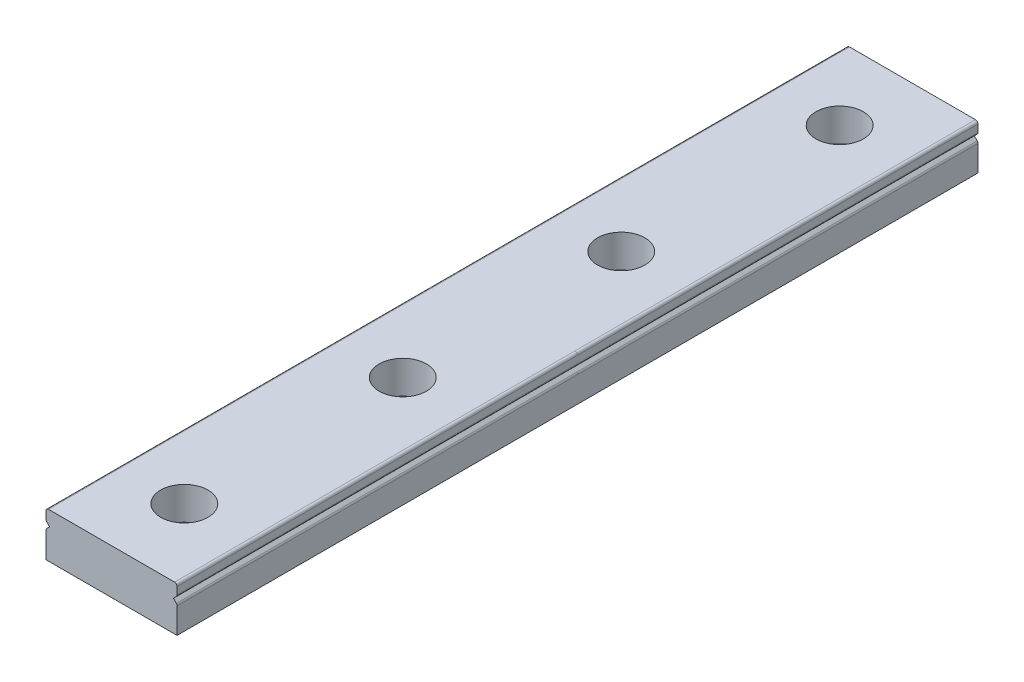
ISO-10303-21;
HEADER;
FILE_DESCRIPTION(('STEP AP214'),'2;1');
FILE_NAME('part.step','',(''),(''),'','','');
FILE_SCHEMA(('AUTOMOTIVE_DESIGN { 1 0 10303 214 1 1 1 1 }'));
ENDSEC;
DATA;
#1=APPLICATION_CONTEXT('core data for automotive mechanical design processes');
#2=APPLICATION_PROTOCOL_DEFINITION('international standard','automotive_design',2000,#1);
#3=PRODUCT_CONTEXT('',#1,'mechanical');
#4=PRODUCT('Part','Part','',(#3));
#5=PRODUCT_RELATED_PRODUCT_CATEGORY('part','',(#4));
#6=PRODUCT_DEFINITION_FORMATION('','',#4);
#7=PRODUCT_DEFINITION_CONTEXT('part definition',#1,'design');
#8=PRODUCT_DEFINITION('design','',#6,#7);
#9=PRODUCT_DEFINITION_SHAPE('','',#8);
#10=(LENGTH_UNIT() NAMED_UNIT(*) SI_UNIT(.MILLI.,.METRE.));
#11=(NAMED_UNIT(*) PLANE_ANGLE_UNIT() SI_UNIT($,.RADIAN.));
#12=(NAMED_UNIT(*) SI_UNIT($,.STERADIAN.) SOLID_ANGLE_UNIT());
#13=UNCERTAINTY_MEASURE_WITH_UNIT(LENGTH_MEASURE(1.E-05),#10,'distance_accuracy_value','');
#14=(GEOMETRIC_REPRESENTATION_CONTEXT(3) GLOBAL_UNCERTAINTY_ASSIGNED_CONTEXT((#13)) GLOBAL_UNIT_ASSIGNED_CONTEXT((#10,
#11,#12)) REPRESENTATION_CONTEXT('',''));
#15=CARTESIAN_POINT('',(0.,0.,0.));
#16=DIRECTION('',(0.,0.,1.));
#17=DIRECTION('',(1.,0.,0.));
#18=AXIS2_PLACEMENT_3D('',#15,#16,#17);
#19=CARTESIAN_POINT('',(0.,0.830210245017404,55.));
#20=DIRECTION('',(0.,1.,0.));
#21=DIRECTION('',(0.,0.,1.));
#22=AXIS2_PLACEMENT_3D('',#19,#20,#21);
#23=PLANE('',#22);
#24=CARTESIAN_POINT('',(0.,0.830210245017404,-45.));
#25=DIRECTION('',(0.,1.,0.));
#26=DIRECTION('',(0.,0.,1.));
#27=AXIS2_PLACEMENT_3D('',#24,#25,#26);
#28=CIRCLE('',#27,1.75);
#29=CARTESIAN_POINT('',(0.,0.830210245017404,-43.25));
#30=VERTEX_POINT('',#29);
#31=EDGE_CURVE('E491',#30,#30,#28,.T.);
#32=ORIENTED_EDGE('',*,*,#31,.T.);
#33=EDGE_LOOP('',(#32));
#34=FACE_BOUND('',#33,.T.);
#35=CARTESIAN_POINT('',(0.,0.830210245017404,-15.));
#36=DIRECTION('',(0.,1.,0.));
#37=DIRECTION('',(0.,0.,1.));
#38=AXIS2_PLACEMENT_3D('',#35,#36,#37);
#39=CIRCLE('',#38,1.75);
#40=CARTESIAN_POINT('',(0.,0.830210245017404,-13.25));
#41=VERTEX_POINT('',#40);
#42=EDGE_CURVE('E495',#41,#41,#39,.T.);
#43=ORIENTED_EDGE('',*,*,#42,.T.);
#44=EDGE_LOOP('',(#43));
#45=FACE_BOUND('',#44,.T.);
#46=CARTESIAN_POINT('',(0.,0.830210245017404,45.));
#47=DIRECTION('',(0.,1.,0.));
#48=DIRECTION('',(0.,0.,1.));
#49=AXIS2_PLACEMENT_3D('',#46,#47,#48);
#50=CIRCLE('',#49,1.75);
#51=CARTESIAN_POINT('',(0.,0.830210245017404,46.75));
#52=VERTEX_POINT('',#51);
#53=EDGE_CURVE('E200',#52,#52,#50,.T.);
#54=ORIENTED_EDGE('',*,*,#53,.T.);
#55=EDGE_LOOP('',(#54));
#56=FACE_BOUND('',#55,.T.);
#57=CARTESIAN_POINT('',(0.,0.830210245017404,15.));
#58=DIRECTION('',(0.,1.,0.));
#59=DIRECTION('',(0.,0.,1.));
#60=AXIS2_PLACEMENT_3D('',#57,#58,#59);
#61=CIRCLE('',#60,1.75);
#62=CARTESIAN_POINT('',(0.,0.830210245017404,16.75));
#63=VERTEX_POINT('',#62);
#64=EDGE_CURVE('E241',#63,#63,#61,.T.);
#65=ORIENTED_EDGE('',*,*,#64,.T.);
#66=EDGE_LOOP('',(#65));
#67=FACE_BOUND('',#66,.T.);
#68=DIRECTION('',(0.,0.,-1.));
#69=VECTOR('',#68,1.);
#70=CARTESIAN_POINT('',(-9.,0.830210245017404,55.));
#71=LINE('',#70,#69);
#72=CARTESIAN_POINT('',(-9.,0.830210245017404,55.));
#73=VERTEX_POINT('',#72);
#74=CARTESIAN_POINT('',(-9.,0.830210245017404,-55.));
#75=VERTEX_POINT('',#74);
#76=EDGE_CURVE('E182',#73,#75,#71,.T.);
#77=ORIENTED_EDGE('',*,*,#76,.T.);
#78=DIRECTION('',(1.,0.,0.));
#79=VECTOR('',#78,1.);
#80=CARTESIAN_POINT('',(0.,0.830210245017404,-55.));
#81=LINE('',#80,#79);
#82=CARTESIAN_POINT('',(9.,0.830210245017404,-55.));
#83=VERTEX_POINT('',#82);
#84=EDGE_CURVE('E185',#75,#83,#81,.T.);
#85=ORIENTED_EDGE('',*,*,#84,.T.);
#86=DIRECTION('',(0.,0.,-1.));
#87=VECTOR('',#86,1.);
#88=CARTESIAN_POINT('',(9.,0.830210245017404,55.));
#89=LINE('',#88,#87);
#90=CARTESIAN_POINT('',(9.,0.830210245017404,55.));
#91=VERTEX_POINT('',#90);
#92=EDGE_CURVE('E282',#91,#83,#89,.T.);
#93=ORIENTED_EDGE('',*,*,#92,.F.);
#94=DIRECTION('',(1.,0.,0.));
#95=VECTOR('',#94,1.);
#96=CARTESIAN_POINT('',(0.,0.830210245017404,55.));
#97=LINE('',#96,#95);
#98=EDGE_CURVE('E186',#73,#91,#97,.T.);
#99=ORIENTED_EDGE('',*,*,#98,.F.);
#100=EDGE_LOOP('',(#77,#85,#93,#99));
#101=FACE_BOUND('',#100,.T.);
#102=ADVANCED_FACE('F32',(#34,#45,#56,#67,#101),#23,.F.);
#103=CARTESIAN_POINT('',(9.,0.830210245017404,55.));
#104=DIRECTION('',(-1.,0.,0.));
#105=DIRECTION('',(0.,0.,1.));
#106=AXIS2_PLACEMENT_3D('',#103,#104,#105);
#107=PLANE('',#106);
#108=DIRECTION('',(0.,1.,0.));
#109=VECTOR('',#108,1.);
#110=CARTESIAN_POINT('',(9.,0.830210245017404,-55.));
#111=LINE('',#110,#109);
#112=CARTESIAN_POINT('',(9.,4.35502525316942,-55.));
#113=VERTEX_POINT('',#112);
#114=EDGE_CURVE('E199',#83,#113,#111,.T.);
#115=ORIENTED_EDGE('',*,*,#114,.T.);
#116=DIRECTION('',(0.,0.,1.));
#117=VECTOR('',#116,1.);
#118=CARTESIAN_POINT('',(9.,4.35502525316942,55.));
#119=LINE('',#118,#117);
#120=CARTESIAN_POINT('',(9.,4.35502525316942,0.));
#121=VERTEX_POINT('',#120);
#122=EDGE_CURVE('E330',#113,#121,#119,.T.);
#123=ORIENTED_EDGE('',*,*,#122,.T.);
#124=DIRECTION('',(0.,0.,-1.));
#125=VECTOR('',#124,1.);
#126=CARTESIAN_POINT('',(9.,4.35502525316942,55.));
#127=LINE('',#126,#125);
#128=CARTESIAN_POINT('',(9.,4.35502525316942,55.));
#129=VERTEX_POINT('',#128);
#130=EDGE_CURVE('E299',#121,#129,#127,.F.);
#131=ORIENTED_EDGE('',*,*,#130,.T.);
#132=DIRECTION('',(0.,1.,0.));
#133=VECTOR('',#132,1.);
#134=CARTESIAN_POINT('',(9.,0.830210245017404,55.));
#135=LINE('',#134,#133);
#136=EDGE_CURVE('E265',#91,#129,#135,.T.);
#137=ORIENTED_EDGE('',*,*,#136,.F.);
#138=ORIENTED_EDGE('',*,*,#92,.T.);
#139=EDGE_LOOP('',(#115,#123,#131,#137,#138));
#140=FACE_BOUND('',#139,.T.);
#141=ADVANCED_FACE('F464',(#140),#107,.F.);
#142=CARTESIAN_POINT('',(8.5,5.,55.));
#143=DIRECTION('',(-0.707106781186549,-0.707106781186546,0.));
#144=DIRECTION('',(0.707106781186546,-0.707106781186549,0.));
#145=AXIS2_PLACEMENT_3D('',#142,#143,#144);
#146=PLANE('',#145);
#147=DIRECTION('',(0.,0.,-1.));
#148=VECTOR('',#147,1.);
#149=CARTESIAN_POINT('',(8.89748737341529,4.60251262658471,55.));
#150=LINE('',#149,#148);
#151=CARTESIAN_POINT('',(8.89748737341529,4.60251262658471,55.));
#152=VERTEX_POINT('',#151);
#153=CARTESIAN_POINT('',(8.89748737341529,4.60251262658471,0.));
#154=VERTEX_POINT('',#153);
#155=EDGE_CURVE('E296',#152,#154,#150,.T.);
#156=ORIENTED_EDGE('',*,*,#155,.T.);
#157=DIRECTION('',(0.,0.,1.));
#158=VECTOR('',#157,1.);
#159=CARTESIAN_POINT('',(8.89748737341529,4.60251262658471,55.));
#160=LINE('',#159,#158);
#161=CARTESIAN_POINT('',(8.89748737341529,4.60251262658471,-55.));
#162=VERTEX_POINT('',#161);
#163=EDGE_CURVE('E335',#154,#162,#160,.F.);
#164=ORIENTED_EDGE('',*,*,#163,.T.);
#165=DIRECTION('',(-0.707106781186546,0.707106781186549,0.));
#166=VECTOR('',#165,1.);
#167=CARTESIAN_POINT('',(8.5,5.,-55.));
#168=LINE('',#167,#166);
#169=CARTESIAN_POINT('',(8.5,5.,-55.));
#170=VERTEX_POINT('',#169);
#171=EDGE_CURVE('E227',#162,#170,#168,.T.);
#172=ORIENTED_EDGE('',*,*,#171,.T.);
#173=DIRECTION('',(0.,0.,-1.));
#174=VECTOR('',#173,1.);
#175=CARTESIAN_POINT('',(8.5,5.,55.));
#176=LINE('',#175,#174);
#177=CARTESIAN_POINT('',(8.5,5.,55.));
#178=VERTEX_POINT('',#177);
#179=EDGE_CURVE('E279',#178,#170,#176,.T.);
#180=ORIENTED_EDGE('',*,*,#179,.F.);
#181=DIRECTION('',(-0.707106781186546,0.707106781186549,0.));
#182=VECTOR('',#181,1.);
#183=CARTESIAN_POINT('',(8.5,5.,55.));
#184=LINE('',#183,#182);
#185=EDGE_CURVE('E268',#152,#178,#184,.T.);
#186=ORIENTED_EDGE('',*,*,#185,.F.);
#187=EDGE_LOOP('',(#156,#164,#172,#180,#186));
#188=FACE_BOUND('',#187,.T.);
#189=ADVANCED_FACE('F455',(#188),#146,.F.);
#190=CARTESIAN_POINT('',(9.,5.5,55.));
#191=DIRECTION('',(-0.707106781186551,0.707106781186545,0.));
#192=DIRECTION('',(-0.707106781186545,-0.707106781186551,0.));
#193=AXIS2_PLACEMENT_3D('',#190,#191,#192);
#194=PLANE('',#193);
#195=DIRECTION('',(0.707106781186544,0.707106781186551,0.));
#196=VECTOR('',#195,1.);
#197=CARTESIAN_POINT('',(9.,5.5,-55.));
#198=LINE('',#197,#196);
#199=CARTESIAN_POINT('',(8.89748737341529,5.39748737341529,-55.));
#200=VERTEX_POINT('',#199);
#201=EDGE_CURVE('E224',#170,#200,#198,.T.);
#202=ORIENTED_EDGE('',*,*,#201,.T.);
#203=DIRECTION('',(0.,0.,1.));
#204=VECTOR('',#203,1.);
#205=CARTESIAN_POINT('',(8.89748737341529,5.39748737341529,55.));
#206=LINE('',#205,#204);
#207=CARTESIAN_POINT('',(8.89748737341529,5.39748737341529,0.));
#208=VERTEX_POINT('',#207);
#209=EDGE_CURVE('E327',#200,#208,#206,.T.);
#210=ORIENTED_EDGE('',*,*,#209,.T.);
#211=DIRECTION('',(0.,0.,-1.));
#212=VECTOR('',#211,1.);
#213=CARTESIAN_POINT('',(8.89748737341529,5.39748737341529,55.));
#214=LINE('',#213,#212);
#215=CARTESIAN_POINT('',(8.89748737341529,5.39748737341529,55.));
#216=VERTEX_POINT('',#215);
#217=EDGE_CURVE('E300',#208,#216,#214,.F.);
#218=ORIENTED_EDGE('',*,*,#217,.T.);
#219=DIRECTION('',(0.707106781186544,0.707106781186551,0.));
#220=VECTOR('',#219,1.);
#221=CARTESIAN_POINT('',(9.,5.5,55.));
#222=LINE('',#221,#220);
#223=EDGE_CURVE('E270',#178,#216,#222,.T.);
#224=ORIENTED_EDGE('',*,*,#223,.F.);
#225=ORIENTED_EDGE('',*,*,#179,.T.);
#226=EDGE_LOOP('',(#202,#210,#218,#224,#225));
#227=FACE_BOUND('',#226,.T.);
#228=ADVANCED_FACE('F449',(#227),#194,.F.);
#229=CARTESIAN_POINT('',(9.,7.,55.));
#230=DIRECTION('',(-1.,0.,0.));
#231=DIRECTION('',(0.,-1.,0.));
#232=AXIS2_PLACEMENT_3D('',#229,#230,#231);
#233=PLANE('',#232);
#234=DIRECTION('',(0.,1.,0.));
#235=VECTOR('',#234,1.);
#236=CARTESIAN_POINT('',(9.,7.,-55.));
#237=LINE('',#236,#235);
#238=CARTESIAN_POINT('',(9.,5.64497474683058,-55.));
#239=VERTEX_POINT('',#238);
#240=CARTESIAN_POINT('',(9.,6.65,-55.));
#241=VERTEX_POINT('',#240);
#242=EDGE_CURVE('E221',#239,#241,#237,.T.);
#243=ORIENTED_EDGE('',*,*,#242,.T.);
#244=DIRECTION('',(0.,0.,1.));
#245=VECTOR('',#244,1.);
#246=CARTESIAN_POINT('',(9.,6.65,55.));
#247=LINE('',#246,#245);
#248=CARTESIAN_POINT('',(9.,6.65,0.));
#249=VERTEX_POINT('',#248);
#250=EDGE_CURVE('E309',#241,#249,#247,.T.);
#251=ORIENTED_EDGE('',*,*,#250,.T.);
#252=DIRECTION('',(0.,0.,-1.));
#253=VECTOR('',#252,1.);
#254=CARTESIAN_POINT('',(9.,6.65,55.));
#255=LINE('',#254,#253);
#256=CARTESIAN_POINT('',(9.,6.65,55.));
#257=VERTEX_POINT('',#256);
#258=EDGE_CURVE('E382',#249,#257,#255,.F.);
#259=ORIENTED_EDGE('',*,*,#258,.T.);
#260=DIRECTION('',(0.,1.,0.));
#261=VECTOR('',#260,1.);
#262=CARTESIAN_POINT('',(9.,7.,55.));
#263=LINE('',#262,#261);
#264=CARTESIAN_POINT('',(9.,5.64497474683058,55.));
#265=VERTEX_POINT('',#264);
#266=EDGE_CURVE('E273',#265,#257,#263,.T.);
#267=ORIENTED_EDGE('',*,*,#266,.F.);
#268=DIRECTION('',(0.,0.,-1.));
#269=VECTOR('',#268,1.);
#270=CARTESIAN_POINT('',(9.,5.64497474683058,55.));
#271=LINE('',#270,#269);
#272=CARTESIAN_POINT('',(9.,5.64497474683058,0.));
#273=VERTEX_POINT('',#272);
#274=EDGE_CURVE('E375',#265,#273,#271,.T.);
#275=ORIENTED_EDGE('',*,*,#274,.T.);
#276=DIRECTION('',(0.,0.,1.));
#277=VECTOR('',#276,1.);
#278=CARTESIAN_POINT('',(9.,5.64497474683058,55.));
#279=LINE('',#278,#277);
#280=EDGE_CURVE('E307',#273,#239,#279,.F.);
#281=ORIENTED_EDGE('',*,*,#280,.T.);
#282=EDGE_LOOP('',(#243,#251,#259,#267,#275,#281));
#283=FACE_BOUND('',#282,.T.);
#284=ADVANCED_FACE('F437',(#283),#233,.F.);
#285=CARTESIAN_POINT('',(0.,7.,55.));
#286=DIRECTION('',(0.,-1.,0.));
#287=DIRECTION('',(0.,0.,-1.));
#288=AXIS2_PLACEMENT_3D('',#285,#286,#287);
#289=PLANE('',#288);
#290=CARTESIAN_POINT('',(0.,7.,-45.));
#291=DIRECTION('',(0.,1.,0.));
#292=DIRECTION('',(0.,0.,1.));
#293=AXIS2_PLACEMENT_3D('',#290,#291,#292);
#294=CIRCLE('',#293,3.25);
#295=CARTESIAN_POINT('',(0.,7.,-41.75));
#296=VERTEX_POINT('',#295);
#297=EDGE_CURVE('E791',#296,#296,#294,.T.);
#298=ORIENTED_EDGE('',*,*,#297,.F.);
#299=EDGE_LOOP('',(#298));
#300=FACE_BOUND('',#299,.T.);
#301=CARTESIAN_POINT('',(0.,7.,-15.));
#302=DIRECTION('',(0.,1.,0.));
#303=DIRECTION('',(0.,0.,1.));
#304=AXIS2_PLACEMENT_3D('',#301,#302,#303);
#305=CIRCLE('',#304,3.25);
#306=CARTESIAN_POINT('',(0.,7.,-11.75));
#307=VERTEX_POINT('',#306);
#308=EDGE_CURVE('E206',#307,#307,#305,.T.);
#309=ORIENTED_EDGE('',*,*,#308,.F.);
#310=EDGE_LOOP('',(#309));
#311=FACE_BOUND('',#310,.T.);
#312=DIRECTION('',(-1.,0.,0.));
#313=VECTOR('',#312,1.);
#314=CARTESIAN_POINT('',(0.,7.,-55.));
#315=LINE('',#314,#313);
#316=CARTESIAN_POINT('',(8.65,7.,-55.));
#317=VERTEX_POINT('',#316);
#318=CARTESIAN_POINT('',(-8.65,7.,-55.));
#319=VERTEX_POINT('',#318);
#320=EDGE_CURVE('E218',#317,#319,#315,.T.);
#321=ORIENTED_EDGE('',*,*,#320,.T.);
#322=DIRECTION('',(0.,0.,1.));
#323=VECTOR('',#322,1.);
#324=CARTESIAN_POINT('',(-8.65,7.,0.));
#325=LINE('',#324,#323);
#326=CARTESIAN_POINT('',(-8.65,7.,0.));
#327=VERTEX_POINT('',#326);
#328=EDGE_CURVE('E339',#319,#327,#325,.T.);
#329=ORIENTED_EDGE('',*,*,#328,.T.);
#330=DIRECTION('',(0.,0.,-1.));
#331=VECTOR('',#330,1.);
#332=CARTESIAN_POINT('',(-8.65,7.,55.));
#333=LINE('',#332,#331);
#334=CARTESIAN_POINT('',(-8.65,7.,55.));
#335=VERTEX_POINT('',#334);
#336=EDGE_CURVE('E395',#327,#335,#333,.F.);
#337=ORIENTED_EDGE('',*,*,#336,.T.);
#338=DIRECTION('',(-1.,0.,0.));
#339=VECTOR('',#338,1.);
#340=CARTESIAN_POINT('',(0.,7.,55.));
#341=LINE('',#340,#339);
#342=CARTESIAN_POINT('',(8.65,7.,55.));
#343=VERTEX_POINT('',#342);
#344=EDGE_CURVE('E276',#343,#335,#341,.T.);
#345=ORIENTED_EDGE('',*,*,#344,.F.);
#346=DIRECTION('',(0.,0.,-1.));
#347=VECTOR('',#346,1.);
#348=CARTESIAN_POINT('',(8.65,7.,55.));
#349=LINE('',#348,#347);
#350=CARTESIAN_POINT('',(8.65,7.,0.));
#351=VERTEX_POINT('',#350);
#352=EDGE_CURVE('E284',#343,#351,#349,.T.);
#353=ORIENTED_EDGE('',*,*,#352,.T.);
#354=DIRECTION('',(0.,0.,1.));
#355=VECTOR('',#354,1.);
#356=CARTESIAN_POINT('',(8.65,7.,55.));
#357=LINE('',#356,#355);
#358=EDGE_CURVE('E315',#351,#317,#357,.F.);
#359=ORIENTED_EDGE('',*,*,#358,.T.);
#360=EDGE_LOOP('',(#321,#329,#337,#345,#353,#359));
#361=FACE_BOUND('',#360,.T.);
#362=CARTESIAN_POINT('',(0.,7.,45.));
#363=DIRECTION('',(0.,1.,0.));
#364=DIRECTION('',(0.,0.,1.));
#365=AXIS2_PLACEMENT_3D('',#362,#363,#364);
#366=CIRCLE('',#365,3.25);
#367=CARTESIAN_POINT('',(0.,7.,48.25));
#368=VERTEX_POINT('',#367);
#369=EDGE_CURVE('E232',#368,#368,#366,.T.);
#370=ORIENTED_EDGE('',*,*,#369,.F.);
#371=EDGE_LOOP('',(#370));
#372=FACE_BOUND('',#371,.T.);
#373=CARTESIAN_POINT('',(0.,7.,15.));
#374=DIRECTION('',(0.,1.,0.));
#375=DIRECTION('',(0.,0.,1.));
#376=AXIS2_PLACEMENT_3D('',#373,#374,#375);
#377=CIRCLE('',#376,3.25);
#378=CARTESIAN_POINT('',(0.,7.,18.25));
#379=VERTEX_POINT('',#378);
#380=EDGE_CURVE('E250',#379,#379,#377,.T.);
#381=ORIENTED_EDGE('',*,*,#380,.F.);
#382=EDGE_LOOP('',(#381));
#383=FACE_BOUND('',#382,.T.);
#384=ADVANCED_FACE('F424',(#300,#311,#361,#372,#383),#289,.F.);
#385=CARTESIAN_POINT('',(0.,0.830210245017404,55.));
#386=DIRECTION('',(0.,0.,1.));
#387=DIRECTION('',(1.,0.,0.));
#388=AXIS2_PLACEMENT_3D('',#385,#386,#387);
#389=PLANE('',#388);
#390=ORIENTED_EDGE('',*,*,#344,.T.);
#391=CARTESIAN_POINT('',(-8.65,6.65,55.));
#392=DIRECTION('',(0.,0.,1.));
#393=DIRECTION('',(1.,0.,0.));
#394=AXIS2_PLACEMENT_3D('',#391,#392,#393);
#395=CIRCLE('',#394,0.35);
#396=CARTESIAN_POINT('',(-9.,6.65,55.));
#397=VERTEX_POINT('',#396);
#398=EDGE_CURVE('E400',#335,#397,#395,.T.);
#399=ORIENTED_EDGE('',*,*,#398,.T.);
#400=DIRECTION('',(0.,1.,0.));
#401=VECTOR('',#400,1.);
#402=CARTESIAN_POINT('',(-9.,7.,55.));
#403=LINE('',#402,#401);
#404=CARTESIAN_POINT('',(-9.,5.64497474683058,55.));
#405=VERTEX_POINT('',#404);
#406=EDGE_CURVE('E253',#405,#397,#403,.T.);
#407=ORIENTED_EDGE('',*,*,#406,.F.);
#408=CARTESIAN_POINT('',(-8.65,5.64497474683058,55.));
#409=DIRECTION('',(0.,0.,1.));
#410=DIRECTION('',(1.,0.,0.));
#411=AXIS2_PLACEMENT_3D('',#408,#409,#410);
#412=CIRCLE('',#411,0.35);
#413=CARTESIAN_POINT('',(-8.89748737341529,5.39748737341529,55.));
#414=VERTEX_POINT('',#413);
#415=EDGE_CURVE('E398',#405,#414,#412,.T.);
#416=ORIENTED_EDGE('',*,*,#415,.T.);
#417=DIRECTION('',(-0.707106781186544,0.707106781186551,0.));
#418=VECTOR('',#417,1.);
#419=CARTESIAN_POINT('',(-9.,5.5,55.));
#420=LINE('',#419,#418);
#421=CARTESIAN_POINT('',(-8.5,5.,55.));
#422=VERTEX_POINT('',#421);
#423=EDGE_CURVE('E256',#422,#414,#420,.T.);
#424=ORIENTED_EDGE('',*,*,#423,.F.);
#425=DIRECTION('',(0.707106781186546,0.707106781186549,0.));
#426=VECTOR('',#425,1.);
#427=CARTESIAN_POINT('',(-8.5,5.,55.));
#428=LINE('',#427,#426);
#429=CARTESIAN_POINT('',(-8.89748737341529,4.60251262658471,55.));
#430=VERTEX_POINT('',#429);
#431=EDGE_CURVE('E259',#430,#422,#428,.T.);
#432=ORIENTED_EDGE('',*,*,#431,.F.);
#433=CARTESIAN_POINT('',(-8.65,4.35502525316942,55.));
#434=DIRECTION('',(0.,0.,1.));
#435=DIRECTION('',(1.,0.,0.));
#436=AXIS2_PLACEMENT_3D('',#433,#434,#435);
#437=CIRCLE('',#436,0.35);
#438=CARTESIAN_POINT('',(-9.,4.35502525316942,55.));
#439=VERTEX_POINT('',#438);
#440=EDGE_CURVE('E366',#430,#439,#437,.T.);
#441=ORIENTED_EDGE('',*,*,#440,.T.);
#442=DIRECTION('',(0.,1.,0.));
#443=VECTOR('',#442,1.);
#444=CARTESIAN_POINT('',(-9.,0.830210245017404,55.));
#445=LINE('',#444,#443);
#446=EDGE_CURVE('E192',#73,#439,#445,.T.);
#447=ORIENTED_EDGE('',*,*,#446,.F.);
#448=ORIENTED_EDGE('',*,*,#98,.T.);
#449=ORIENTED_EDGE('',*,*,#136,.T.);
#450=CARTESIAN_POINT('',(8.65,4.35502525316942,55.));
#451=DIRECTION('',(0.,0.,1.));
#452=DIRECTION('',(1.,0.,0.));
#453=AXIS2_PLACEMENT_3D('',#450,#451,#452);
#454=CIRCLE('',#453,0.35);
#455=EDGE_CURVE('E379',#129,#152,#454,.T.);
#456=ORIENTED_EDGE('',*,*,#455,.T.);
#457=ORIENTED_EDGE('',*,*,#185,.T.);
#458=ORIENTED_EDGE('',*,*,#223,.T.);
#459=CARTESIAN_POINT('',(8.65,5.64497474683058,55.));
#460=DIRECTION('',(0.,0.,1.));
#461=DIRECTION('',(1.,0.,0.));
#462=AXIS2_PLACEMENT_3D('',#459,#460,#461);
#463=CIRCLE('',#462,0.35);
#464=EDGE_CURVE('E381',#216,#265,#463,.T.);
#465=ORIENTED_EDGE('',*,*,#464,.T.);
#466=ORIENTED_EDGE('',*,*,#266,.T.);
#467=CARTESIAN_POINT('',(8.65,6.65,55.));
#468=DIRECTION('',(0.,0.,1.));
#469=DIRECTION('',(1.,0.,0.));
#470=AXIS2_PLACEMENT_3D('',#467,#468,#469);
#471=CIRCLE('',#470,0.35);
#472=EDGE_CURVE('E384',#257,#343,#471,.T.);
#473=ORIENTED_EDGE('',*,*,#472,.T.);
#474=EDGE_LOOP('',(#390,#399,#407,#416,#424,#432,#441,#447,#448,#449,#456,#457,#458,#465,#466,#473));
#475=FACE_BOUND('',#474,.T.);
#476=ADVANCED_FACE('F470',(#475),#389,.T.);
#477=CARTESIAN_POINT('',(8.65,6.65,55.));
#478=DIRECTION('',(0.,0.,-1.));
#479=DIRECTION('',(-1.,0.,0.));
#480=AXIS2_PLACEMENT_3D('',#477,#478,#479);
#481=CYLINDRICAL_SURFACE('',#480,0.35);
#482=ORIENTED_EDGE('',*,*,#472,.F.);
#483=ORIENTED_EDGE('',*,*,#258,.F.);
#484=CARTESIAN_POINT('',(8.65,6.65,0.));
#485=DIRECTION('',(0.,0.,1.));
#486=DIRECTION('',(1.,0.,0.));
#487=AXIS2_PLACEMENT_3D('',#484,#485,#486);
#488=CIRCLE('',#487,0.35);
#489=EDGE_CURVE('E373',#351,#249,#488,.F.);
#490=ORIENTED_EDGE('',*,*,#489,.F.);
#491=ORIENTED_EDGE('',*,*,#352,.F.);
#492=EDGE_LOOP('',(#482,#483,#490,#491));
#493=FACE_BOUND('',#492,.T.);
#494=ADVANCED_FACE('F527',(#493),#481,.T.);
#495=CARTESIAN_POINT('',(8.65,5.64497474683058,55.));
#496=DIRECTION('',(0.,0.,-1.));
#497=DIRECTION('',(-1.,0.,0.));
#498=AXIS2_PLACEMENT_3D('',#495,#496,#497);
#499=CYLINDRICAL_SURFACE('',#498,0.35);
#500=ORIENTED_EDGE('',*,*,#464,.F.);
#501=ORIENTED_EDGE('',*,*,#217,.F.);
#502=CARTESIAN_POINT('',(8.65,5.64497474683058,0.));
#503=DIRECTION('',(0.,0.,1.));
#504=DIRECTION('',(1.,0.,0.));
#505=AXIS2_PLACEMENT_3D('',#502,#503,#504);
#506=CIRCLE('',#505,0.35);
#507=EDGE_CURVE('E293',#273,#208,#506,.F.);
#508=ORIENTED_EDGE('',*,*,#507,.F.);
#509=ORIENTED_EDGE('',*,*,#274,.F.);
#510=EDGE_LOOP('',(#500,#501,#508,#509));
#511=FACE_BOUND('',#510,.T.);
#512=ADVANCED_FACE('F712',(#511),#499,.T.);
#513=CARTESIAN_POINT('',(8.65,4.35502525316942,55.));
#514=DIRECTION('',(0.,0.,-1.));
#515=DIRECTION('',(-1.,0.,0.));
#516=AXIS2_PLACEMENT_3D('',#513,#514,#515);
#517=CYLINDRICAL_SURFACE('',#516,0.35);
#518=ORIENTED_EDGE('',*,*,#455,.F.);
#519=ORIENTED_EDGE('',*,*,#130,.F.);
#520=CARTESIAN_POINT('',(8.65,4.35502525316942,0.));
#521=DIRECTION('',(0.,0.,1.));
#522=DIRECTION('',(1.,0.,0.));
#523=AXIS2_PLACEMENT_3D('',#520,#521,#522);
#524=CIRCLE('',#523,0.35);
#525=EDGE_CURVE('E290',#154,#121,#524,.F.);
#526=ORIENTED_EDGE('',*,*,#525,.F.);
#527=ORIENTED_EDGE('',*,*,#155,.F.);
#528=EDGE_LOOP('',(#518,#519,#526,#527));
#529=FACE_BOUND('',#528,.T.);
#530=ADVANCED_FACE('F468',(#529),#517,.T.);
#531=CARTESIAN_POINT('',(-9.,7.,55.));
#532=DIRECTION('',(-1.,0.,0.));
#533=DIRECTION('',(0.,-1.,0.));
#534=AXIS2_PLACEMENT_3D('',#531,#532,#533);
#535=PLANE('',#534);
#536=DIRECTION('',(0.,0.,-1.));
#537=VECTOR('',#536,1.);
#538=CARTESIAN_POINT('',(-9.,6.65,0.));
#539=LINE('',#538,#537);
#540=CARTESIAN_POINT('',(-9.,6.65,0.));
#541=VERTEX_POINT('',#540);
#542=EDGE_CURVE('E387',#397,#541,#539,.T.);
#543=ORIENTED_EDGE('',*,*,#542,.T.);
#544=DIRECTION('',(0.,0.,1.));
#545=VECTOR('',#544,1.);
#546=CARTESIAN_POINT('',(-9.,6.65,-55.));
#547=LINE('',#546,#545);
#548=CARTESIAN_POINT('',(-9.,6.65,-55.));
#549=VERTEX_POINT('',#548);
#550=EDGE_CURVE('E347',#541,#549,#547,.F.);
#551=ORIENTED_EDGE('',*,*,#550,.T.);
#552=DIRECTION('',(0.,1.,0.));
#553=VECTOR('',#552,1.);
#554=CARTESIAN_POINT('',(-9.,7.,-55.));
#555=LINE('',#554,#553);
#556=CARTESIAN_POINT('',(-9.,5.64497474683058,-55.));
#557=VERTEX_POINT('',#556);
#558=EDGE_CURVE('E216',#557,#549,#555,.T.);
#559=ORIENTED_EDGE('',*,*,#558,.F.);
#560=DIRECTION('',(0.,0.,1.));
#561=VECTOR('',#560,1.);
#562=CARTESIAN_POINT('',(-9.,5.64497474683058,55.));
#563=LINE('',#562,#561);
#564=CARTESIAN_POINT('',(-9.,5.64497474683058,0.));
#565=VERTEX_POINT('',#564);
#566=EDGE_CURVE('E344',#557,#565,#563,.T.);
#567=ORIENTED_EDGE('',*,*,#566,.T.);
#568=DIRECTION('',(0.,0.,-1.));
#569=VECTOR('',#568,1.);
#570=CARTESIAN_POINT('',(-9.,5.64497474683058,55.));
#571=LINE('',#570,#569);
#572=EDGE_CURVE('E304',#565,#405,#571,.F.);
#573=ORIENTED_EDGE('',*,*,#572,.T.);
#574=ORIENTED_EDGE('',*,*,#406,.T.);
#575=EDGE_LOOP('',(#543,#551,#559,#567,#573,#574));
#576=FACE_BOUND('',#575,.T.);
#577=ADVANCED_FACE('F414',(#576),#535,.T.);
#578=CARTESIAN_POINT('',(-9.,5.5,55.));
#579=DIRECTION('',(-0.707106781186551,-0.707106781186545,0.));
#580=DIRECTION('',(0.707106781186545,-0.707106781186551,0.));
#581=AXIS2_PLACEMENT_3D('',#578,#579,#580);
#582=PLANE('',#581);
#583=DIRECTION('',(0.,0.,-1.));
#584=VECTOR('',#583,1.);
#585=CARTESIAN_POINT('',(-8.89748737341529,5.39748737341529,55.));
#586=LINE('',#585,#584);
#587=CARTESIAN_POINT('',(-8.89748737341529,5.39748737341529,0.));
#588=VERTEX_POINT('',#587);
#589=EDGE_CURVE('E369',#414,#588,#586,.T.);
#590=ORIENTED_EDGE('',*,*,#589,.T.);
#591=DIRECTION('',(0.,0.,1.));
#592=VECTOR('',#591,1.);
#593=CARTESIAN_POINT('',(-8.89748737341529,5.39748737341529,55.));
#594=LINE('',#593,#592);
#595=CARTESIAN_POINT('',(-8.89748737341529,5.39748737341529,-55.));
#596=VERTEX_POINT('',#595);
#597=EDGE_CURVE('E46',#588,#596,#594,.F.);
#598=ORIENTED_EDGE('',*,*,#597,.T.);
#599=DIRECTION('',(-0.707106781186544,0.707106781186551,0.));
#600=VECTOR('',#599,1.);
#601=CARTESIAN_POINT('',(-9.,5.5,-55.));
#602=LINE('',#601,#600);
#603=CARTESIAN_POINT('',(-8.5,5.,-55.));
#604=VERTEX_POINT('',#603);
#605=EDGE_CURVE('E208',#604,#596,#602,.T.);
#606=ORIENTED_EDGE('',*,*,#605,.F.);
#607=DIRECTION('',(0.,0.,-1.));
#608=VECTOR('',#607,1.);
#609=CARTESIAN_POINT('',(-8.5,5.,55.));
#610=LINE('',#609,#608);
#611=EDGE_CURVE('E191',#422,#604,#610,.T.);
#612=ORIENTED_EDGE('',*,*,#611,.F.);
#613=ORIENTED_EDGE('',*,*,#423,.T.);
#614=EDGE_LOOP('',(#590,#598,#606,#612,#613));
#615=FACE_BOUND('',#614,.T.);
#616=ADVANCED_FACE('F402',(#615),#582,.T.);
#617=CARTESIAN_POINT('',(-8.5,5.,55.));
#618=DIRECTION('',(-0.707106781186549,0.707106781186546,0.));
#619=DIRECTION('',(-0.707106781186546,-0.707106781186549,0.));
#620=AXIS2_PLACEMENT_3D('',#617,#618,#619);
#621=PLANE('',#620);
#622=DIRECTION('',(0.707106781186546,0.707106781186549,0.));
#623=VECTOR('',#622,1.);
#624=CARTESIAN_POINT('',(-8.5,5.,-55.));
#625=LINE('',#624,#623);
#626=CARTESIAN_POINT('',(-8.89748737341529,4.60251262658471,-55.));
#627=VERTEX_POINT('',#626);
#628=EDGE_CURVE('E205',#627,#604,#625,.T.);
#629=ORIENTED_EDGE('',*,*,#628,.F.);
#630=DIRECTION('',(0.,0.,1.));
#631=VECTOR('',#630,1.);
#632=CARTESIAN_POINT('',(-8.89748737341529,4.60251262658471,55.));
#633=LINE('',#632,#631);
#634=CARTESIAN_POINT('',(-8.89748737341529,4.60251262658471,0.));
#635=VERTEX_POINT('',#634);
#636=EDGE_CURVE('E39',#627,#635,#633,.T.);
#637=ORIENTED_EDGE('',*,*,#636,.T.);
#638=DIRECTION('',(0.,0.,-1.));
#639=VECTOR('',#638,1.);
#640=CARTESIAN_POINT('',(-8.89748737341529,4.60251262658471,55.));
#641=LINE('',#640,#639);
#642=EDGE_CURVE('E310',#635,#430,#641,.F.);
#643=ORIENTED_EDGE('',*,*,#642,.T.);
#644=ORIENTED_EDGE('',*,*,#431,.T.);
#645=ORIENTED_EDGE('',*,*,#611,.T.);
#646=EDGE_LOOP('',(#629,#637,#643,#644,#645));
#647=FACE_BOUND('',#646,.T.);
#648=ADVANCED_FACE('F358',(#647),#621,.T.);
#649=CARTESIAN_POINT('',(-9.,0.830210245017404,55.));
#650=DIRECTION('',(-1.,0.,0.));
#651=DIRECTION('',(0.,0.,1.));
#652=AXIS2_PLACEMENT_3D('',#649,#650,#651);
#653=PLANE('',#652);
#654=DIRECTION('',(0.,0.,-1.));
#655=VECTOR('',#654,1.);
#656=CARTESIAN_POINT('',(-9.,4.35502525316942,55.));
#657=LINE('',#656,#655);
#658=CARTESIAN_POINT('',(-9.,4.35502525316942,0.));
#659=VERTEX_POINT('',#658);
#660=EDGE_CURVE('E367',#439,#659,#657,.T.);
#661=ORIENTED_EDGE('',*,*,#660,.T.);
#662=DIRECTION('',(0.,0.,1.));
#663=VECTOR('',#662,1.);
#664=CARTESIAN_POINT('',(-9.,4.35502525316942,55.));
#665=LINE('',#664,#663);
#666=CARTESIAN_POINT('',(-9.,4.35502525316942,-55.));
#667=VERTEX_POINT('',#666);
#668=EDGE_CURVE('E11',#659,#667,#665,.F.);
#669=ORIENTED_EDGE('',*,*,#668,.T.);
#670=DIRECTION('',(0.,1.,0.));
#671=VECTOR('',#670,1.);
#672=CARTESIAN_POINT('',(-9.,0.830210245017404,-55.));
#673=LINE('',#672,#671);
#674=EDGE_CURVE('E197',#75,#667,#673,.T.);
#675=ORIENTED_EDGE('',*,*,#674,.F.);
#676=ORIENTED_EDGE('',*,*,#76,.F.);
#677=ORIENTED_EDGE('',*,*,#446,.T.);
#678=EDGE_LOOP('',(#661,#669,#675,#676,#677));
#679=FACE_BOUND('',#678,.T.);
#680=ADVANCED_FACE('F203',(#679),#653,.T.);
#681=CARTESIAN_POINT('',(-8.65,6.65,55.));
#682=DIRECTION('',(0.,0.,1.));
#683=DIRECTION('',(1.,0.,0.));
#684=AXIS2_PLACEMENT_3D('',#681,#682,#683);
#685=CYLINDRICAL_SURFACE('',#684,0.35);
#686=ORIENTED_EDGE('',*,*,#398,.F.);
#687=ORIENTED_EDGE('',*,*,#336,.F.);
#688=CARTESIAN_POINT('',(-8.65,6.65,0.));
#689=DIRECTION('',(0.,0.,1.));
#690=DIRECTION('',(1.,0.,0.));
#691=AXIS2_PLACEMENT_3D('',#688,#689,#690);
#692=CIRCLE('',#691,0.35);
#693=EDGE_CURVE('E393',#541,#327,#692,.F.);
#694=ORIENTED_EDGE('',*,*,#693,.F.);
#695=ORIENTED_EDGE('',*,*,#542,.F.);
#696=EDGE_LOOP('',(#686,#687,#694,#695));
#697=FACE_BOUND('',#696,.T.);
#698=ADVANCED_FACE('F663',(#697),#685,.T.);
#699=CARTESIAN_POINT('',(-8.65,5.64497474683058,55.));
#700=DIRECTION('',(0.,0.,-1.));
#701=DIRECTION('',(-1.,0.,0.));
#702=AXIS2_PLACEMENT_3D('',#699,#700,#701);
#703=CYLINDRICAL_SURFACE('',#702,0.35);
#704=ORIENTED_EDGE('',*,*,#415,.F.);
#705=ORIENTED_EDGE('',*,*,#572,.F.);
#706=CARTESIAN_POINT('',(-8.65,5.64497474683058,0.));
#707=DIRECTION('',(0.,0.,1.));
#708=DIRECTION('',(1.,0.,0.));
#709=AXIS2_PLACEMENT_3D('',#706,#707,#708);
#710=CIRCLE('',#709,0.35);
#711=EDGE_CURVE('E391',#588,#565,#710,.F.);
#712=ORIENTED_EDGE('',*,*,#711,.F.);
#713=ORIENTED_EDGE('',*,*,#589,.F.);
#714=EDGE_LOOP('',(#704,#705,#712,#713));
#715=FACE_BOUND('',#714,.T.);
#716=ADVANCED_FACE('F656',(#715),#703,.T.);
#717=CARTESIAN_POINT('',(-8.65,4.35502525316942,55.));
#718=DIRECTION('',(0.,0.,-1.));
#719=DIRECTION('',(-1.,0.,0.));
#720=AXIS2_PLACEMENT_3D('',#717,#718,#719);
#721=CYLINDRICAL_SURFACE('',#720,0.35);
#722=ORIENTED_EDGE('',*,*,#440,.F.);
#723=ORIENTED_EDGE('',*,*,#642,.F.);
#724=CARTESIAN_POINT('',(-8.65,4.35502525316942,0.));
#725=DIRECTION('',(0.,0.,1.));
#726=DIRECTION('',(1.,0.,0.));
#727=AXIS2_PLACEMENT_3D('',#724,#725,#726);
#728=CIRCLE('',#727,0.35);
#729=EDGE_CURVE('E365',#659,#635,#728,.F.);
#730=ORIENTED_EDGE('',*,*,#729,.F.);
#731=ORIENTED_EDGE('',*,*,#660,.F.);
#732=EDGE_LOOP('',(#722,#723,#730,#731));
#733=FACE_BOUND('',#732,.T.);
#734=ADVANCED_FACE('F363',(#733),#721,.T.);
#735=CARTESIAN_POINT('',(0.,7.,15.));
#736=DIRECTION('',(0.,1.,0.));
#737=DIRECTION('',(0.,0.,1.));
#738=AXIS2_PLACEMENT_3D('',#735,#736,#737);
#739=CYLINDRICAL_SURFACE('',#738,3.25);
#740=CARTESIAN_POINT('',(0.,2.5,15.));
#741=DIRECTION('',(0.,1.,0.));
#742=DIRECTION('',(0.,0.,1.));
#743=AXIS2_PLACEMENT_3D('',#740,#741,#742);
#744=CIRCLE('',#743,3.25);
#745=CARTESIAN_POINT('',(0.,2.5,18.25));
#746=VERTEX_POINT('',#745);
#747=EDGE_CURVE('E247',#746,#746,#744,.T.);
#748=ORIENTED_EDGE('',*,*,#747,.F.);
#749=EDGE_LOOP('',(#748));
#750=FACE_BOUND('',#749,.T.);
#751=ORIENTED_EDGE('',*,*,#380,.T.);
#752=EDGE_LOOP('',(#751));
#753=FACE_BOUND('',#752,.T.);
#754=ADVANCED_FACE('F511',(#750,#753),#739,.F.);
#755=CARTESIAN_POINT('',(1.75,2.5,15.));
#756=DIRECTION('',(0.,-1.,0.));
#757=DIRECTION('',(0.,0.,-1.));
#758=AXIS2_PLACEMENT_3D('',#755,#756,#757);
#759=PLANE('',#758);
#760=CARTESIAN_POINT('',(0.,2.5,15.));
#761=DIRECTION('',(0.,1.,0.));
#762=DIRECTION('',(0.,0.,1.));
#763=AXIS2_PLACEMENT_3D('',#760,#761,#762);
#764=CIRCLE('',#763,1.75);
#765=CARTESIAN_POINT('',(0.,2.5,16.75));
#766=VERTEX_POINT('',#765);
#767=EDGE_CURVE('E244',#766,#766,#764,.T.);
#768=ORIENTED_EDGE('',*,*,#767,.F.);
#769=EDGE_LOOP('',(#768));
#770=FACE_BOUND('',#769,.T.);
#771=ORIENTED_EDGE('',*,*,#747,.T.);
#772=EDGE_LOOP('',(#771));
#773=FACE_BOUND('',#772,.T.);
#774=ADVANCED_FACE('F504',(#770,#773),#759,.F.);
#775=CARTESIAN_POINT('',(0.,7.,15.));
#776=DIRECTION('',(0.,1.,0.));
#777=DIRECTION('',(0.,0.,1.));
#778=AXIS2_PLACEMENT_3D('',#775,#776,#777);
#779=CYLINDRICAL_SURFACE('',#778,1.75);
#780=ORIENTED_EDGE('',*,*,#64,.F.);
#781=EDGE_LOOP('',(#780));
#782=FACE_BOUND('',#781,.T.);
#783=ORIENTED_EDGE('',*,*,#767,.T.);
#784=EDGE_LOOP('',(#783));
#785=FACE_BOUND('',#784,.T.);
#786=ADVANCED_FACE('F500',(#782,#785),#779,.F.);
#787=CARTESIAN_POINT('',(0.,7.,45.));
#788=DIRECTION('',(0.,1.,0.));
#789=DIRECTION('',(0.,0.,1.));
#790=AXIS2_PLACEMENT_3D('',#787,#788,#789);
#791=CYLINDRICAL_SURFACE('',#790,3.25);
#792=CARTESIAN_POINT('',(0.,2.5,45.));
#793=DIRECTION('',(0.,1.,0.));
#794=DIRECTION('',(0.,0.,1.));
#795=AXIS2_PLACEMENT_3D('',#792,#793,#794);
#796=CIRCLE('',#795,3.25);
#797=CARTESIAN_POINT('',(0.,2.5,48.25));
#798=VERTEX_POINT('',#797);
#799=EDGE_CURVE('E238',#798,#798,#796,.T.);
#800=ORIENTED_EDGE('',*,*,#799,.F.);
#801=EDGE_LOOP('',(#800));
#802=FACE_BOUND('',#801,.T.);
#803=ORIENTED_EDGE('',*,*,#369,.T.);
#804=EDGE_LOOP('',(#803));
#805=FACE_BOUND('',#804,.T.);
#806=ADVANCED_FACE('F503',(#802,#805),#791,.F.);
#807=CARTESIAN_POINT('',(1.75,2.5,45.));
#808=DIRECTION('',(0.,-1.,0.));
#809=DIRECTION('',(0.,0.,-1.));
#810=AXIS2_PLACEMENT_3D('',#807,#808,#809);
#811=PLANE('',#810);
#812=CARTESIAN_POINT('',(0.,2.5,45.));
#813=DIRECTION('',(0.,1.,0.));
#814=DIRECTION('',(0.,0.,1.));
#815=AXIS2_PLACEMENT_3D('',#812,#813,#814);
#816=CIRCLE('',#815,1.75);
#817=CARTESIAN_POINT('',(0.,2.5,46.75));
#818=VERTEX_POINT('',#817);
#819=EDGE_CURVE('E235',#818,#818,#816,.T.);
#820=ORIENTED_EDGE('',*,*,#819,.F.);
#821=EDGE_LOOP('',(#820));
#822=FACE_BOUND('',#821,.T.);
#823=ORIENTED_EDGE('',*,*,#799,.T.);
#824=EDGE_LOOP('',(#823));
#825=FACE_BOUND('',#824,.T.);
#826=ADVANCED_FACE('F622',(#822,#825),#811,.F.);
#827=CARTESIAN_POINT('',(0.,7.,45.));
#828=DIRECTION('',(0.,1.,0.));
#829=DIRECTION('',(0.,0.,1.));
#830=AXIS2_PLACEMENT_3D('',#827,#828,#829);
#831=CYLINDRICAL_SURFACE('',#830,1.75);
#832=ORIENTED_EDGE('',*,*,#53,.F.);
#833=EDGE_LOOP('',(#832));
#834=FACE_BOUND('',#833,.T.);
#835=ORIENTED_EDGE('',*,*,#819,.T.);
#836=EDGE_LOOP('',(#835));
#837=FACE_BOUND('',#836,.T.);
#838=ADVANCED_FACE('F506',(#834,#837),#831,.F.);
#839=CARTESIAN_POINT('',(0.,0.830210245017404,-55.));
#840=DIRECTION('',(0.,0.,-1.));
#841=DIRECTION('',(1.,0.,0.));
#842=AXIS2_PLACEMENT_3D('',#839,#840,#841);
#843=PLANE('',#842);
#844=ORIENTED_EDGE('',*,*,#558,.T.);
#845=CARTESIAN_POINT('',(-8.65,6.65,-55.));
#846=DIRECTION('',(0.,0.,-1.));
#847=DIRECTION('',(-1.,0.,0.));
#848=AXIS2_PLACEMENT_3D('',#845,#846,#847);
#849=CIRCLE('',#848,0.35);
#850=EDGE_CURVE('E352',#549,#319,#849,.T.);
#851=ORIENTED_EDGE('',*,*,#850,.T.);
#852=ORIENTED_EDGE('',*,*,#320,.F.);
#853=CARTESIAN_POINT('',(8.65,6.65,-55.));
#854=DIRECTION('',(0.,0.,-1.));
#855=DIRECTION('',(-1.,0.,0.));
#856=AXIS2_PLACEMENT_3D('',#853,#854,#855);
#857=CIRCLE('',#856,0.35);
#858=EDGE_CURVE('E325',#317,#241,#857,.T.);
#859=ORIENTED_EDGE('',*,*,#858,.T.);
#860=ORIENTED_EDGE('',*,*,#242,.F.);
#861=CARTESIAN_POINT('',(8.65,5.64497474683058,-55.));
#862=DIRECTION('',(0.,0.,-1.));
#863=DIRECTION('',(-1.,0.,0.));
#864=AXIS2_PLACEMENT_3D('',#861,#862,#863);
#865=CIRCLE('',#864,0.35);
#866=EDGE_CURVE('E323',#239,#200,#865,.T.);
#867=ORIENTED_EDGE('',*,*,#866,.T.);
#868=ORIENTED_EDGE('',*,*,#201,.F.);
#869=ORIENTED_EDGE('',*,*,#171,.F.);
#870=CARTESIAN_POINT('',(8.65,4.35502525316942,-55.));
#871=DIRECTION('',(0.,0.,-1.));
#872=DIRECTION('',(-1.,0.,0.));
#873=AXIS2_PLACEMENT_3D('',#870,#871,#872);
#874=CIRCLE('',#873,0.35);
#875=EDGE_CURVE('E319',#162,#113,#874,.T.);
#876=ORIENTED_EDGE('',*,*,#875,.T.);
#877=ORIENTED_EDGE('',*,*,#114,.F.);
#878=ORIENTED_EDGE('',*,*,#84,.F.);
#879=ORIENTED_EDGE('',*,*,#674,.T.);
#880=CARTESIAN_POINT('',(-8.65,4.35502525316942,-55.));
#881=DIRECTION('',(0.,0.,-1.));
#882=DIRECTION('',(-1.,0.,0.));
#883=AXIS2_PLACEMENT_3D('',#880,#881,#882);
#884=CIRCLE('',#883,0.35);
#885=EDGE_CURVE('E54',#667,#627,#884,.T.);
#886=ORIENTED_EDGE('',*,*,#885,.T.);
#887=ORIENTED_EDGE('',*,*,#628,.T.);
#888=ORIENTED_EDGE('',*,*,#605,.T.);
#889=CARTESIAN_POINT('',(-8.65,5.64497474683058,-55.));
#890=DIRECTION('',(0.,0.,-1.));
#891=DIRECTION('',(-1.,0.,0.));
#892=AXIS2_PLACEMENT_3D('',#889,#890,#891);
#893=CIRCLE('',#892,0.35);
#894=EDGE_CURVE('E350',#596,#557,#893,.T.);
#895=ORIENTED_EDGE('',*,*,#894,.T.);
#896=EDGE_LOOP('',(#844,#851,#852,#859,#860,#867,#868,#869,#876,#877,#878,#879,#886,#887,#888,#895));
#897=FACE_BOUND('',#896,.T.);
#898=ADVANCED_FACE('F196',(#897),#843,.T.);
#899=CARTESIAN_POINT('',(8.65,6.65,55.));
#900=DIRECTION('',(0.,0.,1.));
#901=DIRECTION('',(1.,0.,0.));
#902=AXIS2_PLACEMENT_3D('',#899,#900,#901);
#903=CYLINDRICAL_SURFACE('',#902,0.35);
#904=ORIENTED_EDGE('',*,*,#858,.F.);
#905=ORIENTED_EDGE('',*,*,#358,.F.);
#906=ORIENTED_EDGE('',*,*,#489,.T.);
#907=ORIENTED_EDGE('',*,*,#250,.F.);
#908=EDGE_LOOP('',(#904,#905,#906,#907));
#909=FACE_BOUND('',#908,.T.);
#910=ADVANCED_FACE('F432',(#909),#903,.T.);
#911=CARTESIAN_POINT('',(8.65,5.64497474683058,55.));
#912=DIRECTION('',(0.,0.,1.));
#913=DIRECTION('',(1.,0.,0.));
#914=AXIS2_PLACEMENT_3D('',#911,#912,#913);
#915=CYLINDRICAL_SURFACE('',#914,0.35);
#916=ORIENTED_EDGE('',*,*,#866,.F.);
#917=ORIENTED_EDGE('',*,*,#280,.F.);
#918=ORIENTED_EDGE('',*,*,#507,.T.);
#919=ORIENTED_EDGE('',*,*,#209,.F.);
#920=EDGE_LOOP('',(#916,#917,#918,#919));
#921=FACE_BOUND('',#920,.T.);
#922=ADVANCED_FACE('F444',(#921),#915,.T.);
#923=CARTESIAN_POINT('',(8.65,4.35502525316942,55.));
#924=DIRECTION('',(0.,0.,1.));
#925=DIRECTION('',(1.,0.,0.));
#926=AXIS2_PLACEMENT_3D('',#923,#924,#925);
#927=CYLINDRICAL_SURFACE('',#926,0.35);
#928=ORIENTED_EDGE('',*,*,#875,.F.);
#929=ORIENTED_EDGE('',*,*,#163,.F.);
#930=ORIENTED_EDGE('',*,*,#525,.T.);
#931=ORIENTED_EDGE('',*,*,#122,.F.);
#932=EDGE_LOOP('',(#928,#929,#930,#931));
#933=FACE_BOUND('',#932,.T.);
#934=ADVANCED_FACE('F461',(#933),#927,.T.);
#935=CARTESIAN_POINT('',(-8.65,6.65,55.));
#936=DIRECTION('',(0.,0.,-1.));
#937=DIRECTION('',(-1.,0.,0.));
#938=AXIS2_PLACEMENT_3D('',#935,#936,#937);
#939=CYLINDRICAL_SURFACE('',#938,0.35);
#940=ORIENTED_EDGE('',*,*,#850,.F.);
#941=ORIENTED_EDGE('',*,*,#550,.F.);
#942=ORIENTED_EDGE('',*,*,#693,.T.);
#943=ORIENTED_EDGE('',*,*,#328,.F.);
#944=EDGE_LOOP('',(#940,#941,#942,#943));
#945=FACE_BOUND('',#944,.T.);
#946=ADVANCED_FACE('F419',(#945),#939,.T.);
#947=CARTESIAN_POINT('',(-8.65,5.64497474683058,55.));
#948=DIRECTION('',(0.,0.,1.));
#949=DIRECTION('',(1.,0.,0.));
#950=AXIS2_PLACEMENT_3D('',#947,#948,#949);
#951=CYLINDRICAL_SURFACE('',#950,0.35);
#952=ORIENTED_EDGE('',*,*,#894,.F.);
#953=ORIENTED_EDGE('',*,*,#597,.F.);
#954=ORIENTED_EDGE('',*,*,#711,.T.);
#955=ORIENTED_EDGE('',*,*,#566,.F.);
#956=EDGE_LOOP('',(#952,#953,#954,#955));
#957=FACE_BOUND('',#956,.T.);
#958=ADVANCED_FACE('F409',(#957),#951,.T.);
#959=CARTESIAN_POINT('',(-8.65,4.35502525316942,55.));
#960=DIRECTION('',(0.,0.,1.));
#961=DIRECTION('',(1.,0.,0.));
#962=AXIS2_PLACEMENT_3D('',#959,#960,#961);
#963=CYLINDRICAL_SURFACE('',#962,0.35);
#964=ORIENTED_EDGE('',*,*,#885,.F.);
#965=ORIENTED_EDGE('',*,*,#668,.F.);
#966=ORIENTED_EDGE('',*,*,#729,.T.);
#967=ORIENTED_EDGE('',*,*,#636,.F.);
#968=EDGE_LOOP('',(#964,#965,#966,#967));
#969=FACE_BOUND('',#968,.T.);
#970=ADVANCED_FACE('F471',(#969),#963,.T.);
#971=CARTESIAN_POINT('',(0.,7.,-15.));
#972=DIRECTION('',(0.,1.,0.));
#973=DIRECTION('',(0.,0.,1.));
#974=AXIS2_PLACEMENT_3D('',#971,#972,#973);
#975=CYLINDRICAL_SURFACE('',#974,3.25);
#976=CARTESIAN_POINT('',(0.,2.5,-15.));
#977=DIRECTION('',(0.,1.,0.));
#978=DIRECTION('',(0.,0.,1.));
#979=AXIS2_PLACEMENT_3D('',#976,#977,#978);
#980=CIRCLE('',#979,3.25);
#981=CARTESIAN_POINT('',(0.,2.5,-11.75));
#982=VERTEX_POINT('',#981);
#983=EDGE_CURVE('E211',#982,#982,#980,.T.);
#984=ORIENTED_EDGE('',*,*,#983,.F.);
#985=EDGE_LOOP('',(#984));
#986=FACE_BOUND('',#985,.T.);
#987=ORIENTED_EDGE('',*,*,#308,.T.);
#988=EDGE_LOOP('',(#987));
#989=FACE_BOUND('',#988,.T.);
#990=ADVANCED_FACE('F473',(#986,#989),#975,.F.);
#991=CARTESIAN_POINT('',(1.75,2.5,-15.));
#992=DIRECTION('',(0.,-1.,0.));
#993=DIRECTION('',(0.,0.,-1.));
#994=AXIS2_PLACEMENT_3D('',#991,#992,#993);
#995=PLANE('',#994);
#996=CARTESIAN_POINT('',(0.,2.5,-15.));
#997=DIRECTION('',(0.,1.,0.));
#998=DIRECTION('',(0.,0.,1.));
#999=AXIS2_PLACEMENT_3D('',#996,#997,#998);
#1000=CIRCLE('',#999,1.75);
#1001=CARTESIAN_POINT('',(0.,2.5,-13.25));
#1002=VERTEX_POINT('',#1001);
#1003=EDGE_CURVE('E798',#1002,#1002,#1000,.T.);
#1004=ORIENTED_EDGE('',*,*,#1003,.F.);
#1005=EDGE_LOOP('',(#1004));
#1006=FACE_BOUND('',#1005,.T.);
#1007=ORIENTED_EDGE('',*,*,#983,.T.);
#1008=EDGE_LOOP('',(#1007));
#1009=FACE_BOUND('',#1008,.T.);
#1010=ADVANCED_FACE('F479',(#1006,#1009),#995,.F.);
#1011=CARTESIAN_POINT('',(0.,7.,-15.));
#1012=DIRECTION('',(0.,1.,0.));
#1013=DIRECTION('',(0.,0.,1.));
#1014=AXIS2_PLACEMENT_3D('',#1011,#1012,#1013);
#1015=CYLINDRICAL_SURFACE('',#1014,1.75);
#1016=ORIENTED_EDGE('',*,*,#42,.F.);
#1017=EDGE_LOOP('',(#1016));
#1018=FACE_BOUND('',#1017,.T.);
#1019=ORIENTED_EDGE('',*,*,#1003,.T.);
#1020=EDGE_LOOP('',(#1019));
#1021=FACE_BOUND('',#1020,.T.);
#1022=ADVANCED_FACE('F750',(#1018,#1021),#1015,.F.);
#1023=CARTESIAN_POINT('',(0.,7.,-45.));
#1024=DIRECTION('',(0.,1.,0.));
#1025=DIRECTION('',(0.,0.,1.));
#1026=AXIS2_PLACEMENT_3D('',#1023,#1024,#1025);
#1027=CYLINDRICAL_SURFACE('',#1026,3.25);
#1028=CARTESIAN_POINT('',(0.,2.5,-45.));
#1029=DIRECTION('',(0.,1.,0.));
#1030=DIRECTION('',(0.,0.,1.));
#1031=AXIS2_PLACEMENT_3D('',#1028,#1029,#1030);
#1032=CIRCLE('',#1031,3.25);
#1033=CARTESIAN_POINT('',(0.,2.5,-41.75));
#1034=VERTEX_POINT('',#1033);
#1035=EDGE_CURVE('E788',#1034,#1034,#1032,.T.);
#1036=ORIENTED_EDGE('',*,*,#1035,.F.);
#1037=EDGE_LOOP('',(#1036));
#1038=FACE_BOUND('',#1037,.T.);
#1039=ORIENTED_EDGE('',*,*,#297,.T.);
#1040=EDGE_LOOP('',(#1039));
#1041=FACE_BOUND('',#1040,.T.);
#1042=ADVANCED_FACE('F758',(#1038,#1041),#1027,.F.);
#1043=CARTESIAN_POINT('',(1.75,2.5,-45.));
#1044=DIRECTION('',(0.,-1.,0.));
#1045=DIRECTION('',(0.,0.,-1.));
#1046=AXIS2_PLACEMENT_3D('',#1043,#1044,#1045);
#1047=PLANE('',#1046);
#1048=CARTESIAN_POINT('',(0.,2.5,-45.));
#1049=DIRECTION('',(0.,1.,0.));
#1050=DIRECTION('',(0.,0.,1.));
#1051=AXIS2_PLACEMENT_3D('',#1048,#1049,#1050);
#1052=CIRCLE('',#1051,1.75);
#1053=CARTESIAN_POINT('',(0.,2.5,-43.25));
#1054=VERTEX_POINT('',#1053);
#1055=EDGE_CURVE('E787',#1054,#1054,#1052,.T.);
#1056=ORIENTED_EDGE('',*,*,#1055,.F.);
#1057=EDGE_LOOP('',(#1056));
#1058=FACE_BOUND('',#1057,.T.);
#1059=ORIENTED_EDGE('',*,*,#1035,.T.);
#1060=EDGE_LOOP('',(#1059));
#1061=FACE_BOUND('',#1060,.T.);
#1062=ADVANCED_FACE('F766',(#1058,#1061),#1047,.F.);
#1063=CARTESIAN_POINT('',(0.,7.,-45.));
#1064=DIRECTION('',(0.,1.,0.));
#1065=DIRECTION('',(0.,0.,1.));
#1066=AXIS2_PLACEMENT_3D('',#1063,#1064,#1065);
#1067=CYLINDRICAL_SURFACE('',#1066,1.75);
#1068=ORIENTED_EDGE('',*,*,#31,.F.);
#1069=EDGE_LOOP('',(#1068));
#1070=FACE_BOUND('',#1069,.T.);
#1071=ORIENTED_EDGE('',*,*,#1055,.T.);
#1072=EDGE_LOOP('',(#1071));
#1073=FACE_BOUND('',#1072,.T.);
#1074=ADVANCED_FACE('F774',(#1070,#1073),#1067,.F.);
#1075=CLOSED_SHELL('',(#102,#141,#189,#228,#284,#384,#476,#494,#512,#530,#577,#616,#648,#680,
#698,#716,#734,#754,#774,#786,#806,#826,#838,#898,#910,#922,#934,#946,#958,#970,#990,#1010,
#1022,#1042,#1062,#1074));
#1076=MANIFOLD_SOLID_BREP('B2',#1075);
#1077=ADVANCED_BREP_SHAPE_REPRESENTATION('',(#18,#1076),#14);
#1078=SHAPE_DEFINITION_REPRESENTATION(#9,#1077);
ENDSEC;
END-ISO-10303-21;
